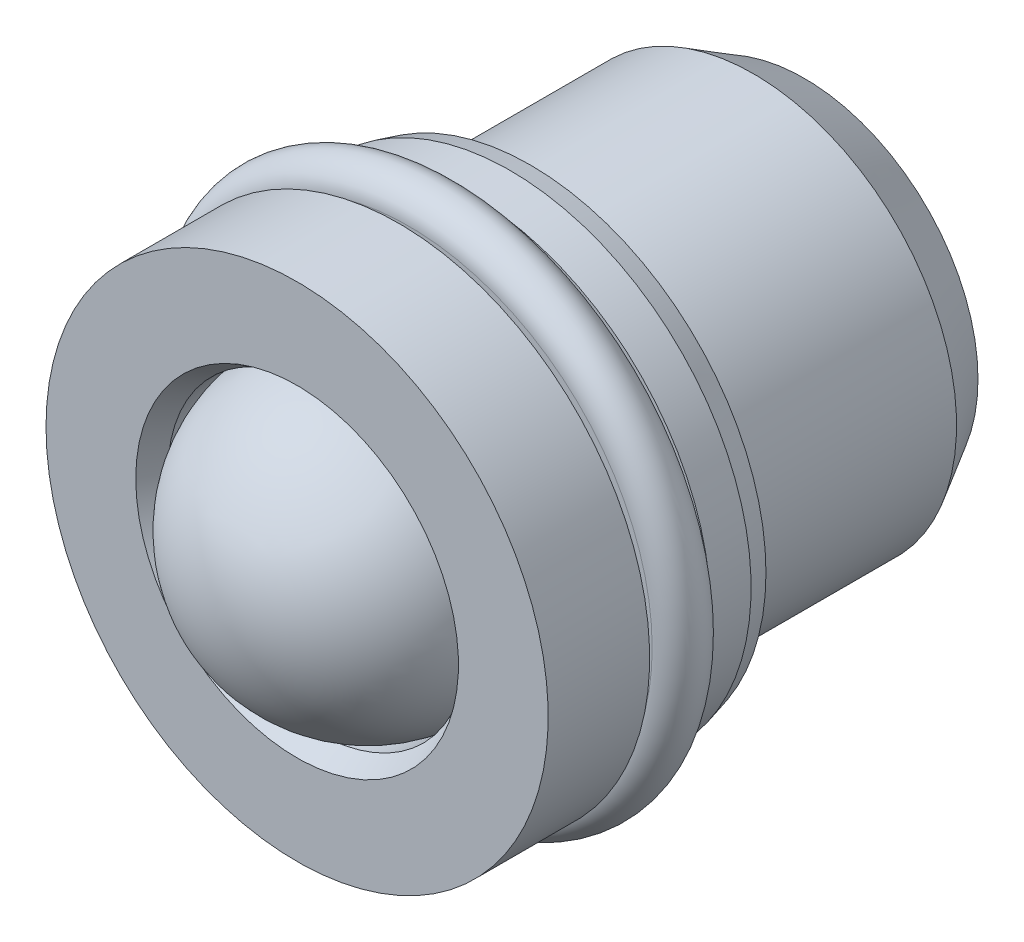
ISO-10303-21;
HEADER;
FILE_DESCRIPTION(('STEP AP214'),'2;1');
FILE_NAME('part.step','',(''),(''),'','','');
FILE_SCHEMA(('AUTOMOTIVE_DESIGN { 1 0 10303 214 1 1 1 1 }'));
ENDSEC;
DATA;
#1=APPLICATION_CONTEXT('core data for automotive mechanical design processes');
#2=APPLICATION_PROTOCOL_DEFINITION('international standard','automotive_design',2000,#1);
#3=PRODUCT_CONTEXT('',#1,'mechanical');
#4=PRODUCT('Part','Part','',(#3));
#5=PRODUCT_RELATED_PRODUCT_CATEGORY('part','',(#4));
#6=PRODUCT_DEFINITION_FORMATION('','',#4);
#7=PRODUCT_DEFINITION_CONTEXT('part definition',#1,'design');
#8=PRODUCT_DEFINITION('design','',#6,#7);
#9=PRODUCT_DEFINITION_SHAPE('','',#8);
#10=(LENGTH_UNIT() NAMED_UNIT(*) SI_UNIT(.MILLI.,.METRE.));
#11=(NAMED_UNIT(*) PLANE_ANGLE_UNIT() SI_UNIT($,.RADIAN.));
#12=(NAMED_UNIT(*) SI_UNIT($,.STERADIAN.) SOLID_ANGLE_UNIT());
#13=UNCERTAINTY_MEASURE_WITH_UNIT(LENGTH_MEASURE(1.E-05),#10,'distance_accuracy_value','');
#14=(GEOMETRIC_REPRESENTATION_CONTEXT(3) GLOBAL_UNCERTAINTY_ASSIGNED_CONTEXT((#13)) GLOBAL_UNIT_ASSIGNED_CONTEXT((#10,
#11,#12)) REPRESENTATION_CONTEXT('',''));
#15=CARTESIAN_POINT('',(0.,0.,0.));
#16=DIRECTION('',(0.,0.,1.));
#17=DIRECTION('',(1.,0.,0.));
#18=AXIS2_PLACEMENT_3D('',#15,#16,#17);
#19=CARTESIAN_POINT('',(0.,0.,-2.2));
#20=DIRECTION('',(0.,0.,1.));
#21=DIRECTION('',(1.,0.,0.));
#22=AXIS2_PLACEMENT_3D('',#19,#20,#21);
#23=CONICAL_SURFACE('',#22,2.,0.523598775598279);
#24=CARTESIAN_POINT('',(0.,0.,-2.7));
#25=DIRECTION('',(0.,0.,-1.));
#26=DIRECTION('',(-1.,0.,0.));
#27=AXIS2_PLACEMENT_3D('',#24,#25,#26);
#28=CIRCLE('',#27,1.7113248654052);
#29=CARTESIAN_POINT('',(-1.7113248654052,0.,-2.7));
#30=VERTEX_POINT('',#29);
#31=EDGE_CURVE('E18',#30,#30,#28,.T.);
#32=ORIENTED_EDGE('',*,*,#31,.F.);
#33=EDGE_LOOP('',(#32));
#34=FACE_BOUND('',#33,.T.);
#35=CARTESIAN_POINT('',(0.,0.,-2.2));
#36=DIRECTION('',(0.,0.,-1.));
#37=DIRECTION('',(-1.,0.,0.));
#38=AXIS2_PLACEMENT_3D('',#35,#36,#37);
#39=CIRCLE('',#38,2.);
#40=CARTESIAN_POINT('',(-2.,0.,-2.2));
#41=VERTEX_POINT('',#40);
#42=EDGE_CURVE('E70',#41,#41,#39,.T.);
#43=ORIENTED_EDGE('',*,*,#42,.T.);
#44=EDGE_LOOP('',(#43));
#45=FACE_BOUND('',#44,.T.);
#46=ADVANCED_FACE('F12',(#34,#45),#23,.T.);
#47=CARTESIAN_POINT('',(0.,1.7113248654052,-2.7));
#48=DIRECTION('',(0.,0.,1.));
#49=DIRECTION('',(1.,0.,0.));
#50=AXIS2_PLACEMENT_3D('',#47,#48,#49);
#51=PLANE('',#50);
#52=ORIENTED_EDGE('',*,*,#31,.T.);
#53=EDGE_LOOP('',(#52));
#54=FACE_BOUND('',#53,.T.);
#55=ADVANCED_FACE('F168',(#54),#51,.F.);
#56=CARTESIAN_POINT('',(0.,0.,2.3));
#57=DIRECTION('',(0.,0.,-1.));
#58=DIRECTION('',(-1.,0.,0.));
#59=AXIS2_PLACEMENT_3D('',#56,#57,#58);
#60=CYLINDRICAL_SURFACE('',#59,1.475);
#61=CARTESIAN_POINT('',(0.,0.,1.87271780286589));
#62=DIRECTION('',(0.,0.,-1.));
#63=DIRECTION('',(-1.,0.,0.));
#64=AXIS2_PLACEMENT_3D('',#61,#62,#63);
#65=CIRCLE('',#64,1.475);
#66=CARTESIAN_POINT('',(-1.475,0.,1.87271780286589));
#67=VERTEX_POINT('',#66);
#68=EDGE_CURVE('E8',#67,#67,#65,.T.);
#69=ORIENTED_EDGE('',*,*,#68,.T.);
#70=EDGE_LOOP('',(#69));
#71=FACE_BOUND('',#70,.T.);
#72=CARTESIAN_POINT('',(0.,0.,2.1));
#73=DIRECTION('',(0.,0.,-1.));
#74=DIRECTION('',(-1.,0.,0.));
#75=AXIS2_PLACEMENT_3D('',#72,#73,#74);
#76=CIRCLE('',#75,1.475);
#77=CARTESIAN_POINT('',(-1.475,0.,2.1));
#78=VERTEX_POINT('',#77);
#79=EDGE_CURVE('E22',#78,#78,#76,.T.);
#80=ORIENTED_EDGE('',*,*,#79,.F.);
#81=EDGE_LOOP('',(#80));
#82=FACE_BOUND('',#81,.T.);
#83=ADVANCED_FACE('F163',(#71,#82),#60,.F.);
#84=CARTESIAN_POINT('',(0.,0.,2.1));
#85=DIRECTION('',(0.,0.,1.));
#86=DIRECTION('',(1.,0.,0.));
#87=AXIS2_PLACEMENT_3D('',#84,#85,#86);
#88=CONICAL_SURFACE('',#87,1.475,0.523598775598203);
#89=CARTESIAN_POINT('',(0.,0.,2.3));
#90=DIRECTION('',(0.,0.,-1.));
#91=DIRECTION('',(-1.,0.,0.));
#92=AXIS2_PLACEMENT_3D('',#89,#90,#91);
#93=CIRCLE('',#92,1.5904700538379);
#94=CARTESIAN_POINT('',(-1.5904700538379,0.,2.3));
#95=VERTEX_POINT('',#94);
#96=EDGE_CURVE('E26',#95,#95,#93,.T.);
#97=ORIENTED_EDGE('',*,*,#96,.F.);
#98=EDGE_LOOP('',(#97));
#99=FACE_BOUND('',#98,.T.);
#100=ORIENTED_EDGE('',*,*,#79,.T.);
#101=EDGE_LOOP('',(#100));
#102=FACE_BOUND('',#101,.T.);
#103=ADVANCED_FACE('F157',(#99,#102),#88,.F.);
#104=CARTESIAN_POINT('',(0.,1.5904700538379,2.3));
#105=DIRECTION('',(0.,0.,-1.));
#106=DIRECTION('',(-1.,0.,0.));
#107=AXIS2_PLACEMENT_3D('',#104,#105,#106);
#108=PLANE('',#107);
#109=CARTESIAN_POINT('',(0.,0.,2.3));
#110=DIRECTION('',(0.,0.,-1.));
#111=DIRECTION('',(-1.,0.,0.));
#112=AXIS2_PLACEMENT_3D('',#109,#110,#111);
#113=CIRCLE('',#112,2.475);
#114=CARTESIAN_POINT('',(-2.475,0.,2.3));
#115=VERTEX_POINT('',#114);
#116=EDGE_CURVE('E31',#115,#115,#113,.T.);
#117=ORIENTED_EDGE('',*,*,#116,.F.);
#118=EDGE_LOOP('',(#117));
#119=FACE_BOUND('',#118,.T.);
#120=ORIENTED_EDGE('',*,*,#96,.T.);
#121=EDGE_LOOP('',(#120));
#122=FACE_BOUND('',#121,.T.);
#123=ADVANCED_FACE('F151',(#119,#122),#108,.F.);
#124=CARTESIAN_POINT('',(0.,0.,2.3));
#125=DIRECTION('',(0.,0.,-1.));
#126=DIRECTION('',(-1.,0.,0.));
#127=AXIS2_PLACEMENT_3D('',#124,#125,#126);
#128=CYLINDRICAL_SURFACE('',#127,2.475);
#129=CARTESIAN_POINT('',(0.,0.,1.3));
#130=DIRECTION('',(0.,0.,-1.));
#131=DIRECTION('',(-1.,0.,0.));
#132=AXIS2_PLACEMENT_3D('',#129,#130,#131);
#133=CIRCLE('',#132,2.475);
#134=CARTESIAN_POINT('',(-2.475,0.,1.3));
#135=VERTEX_POINT('',#134);
#136=EDGE_CURVE('E34',#135,#135,#133,.T.);
#137=ORIENTED_EDGE('',*,*,#136,.F.);
#138=EDGE_LOOP('',(#137));
#139=FACE_BOUND('',#138,.T.);
#140=ORIENTED_EDGE('',*,*,#116,.T.);
#141=EDGE_LOOP('',(#140));
#142=FACE_BOUND('',#141,.T.);
#143=ADVANCED_FACE('F145',(#139,#142),#128,.T.);
#144=CARTESIAN_POINT('',(0.,2.475,1.3));
#145=DIRECTION('',(0.,0.,1.));
#146=DIRECTION('',(1.,0.,0.));
#147=AXIS2_PLACEMENT_3D('',#144,#145,#146);
#148=PLANE('',#147);
#149=CARTESIAN_POINT('',(0.,0.,1.3));
#150=DIRECTION('',(0.,0.,-1.));
#151=DIRECTION('',(-1.,0.,0.));
#152=AXIS2_PLACEMENT_3D('',#149,#150,#151);
#153=CIRCLE('',#152,2.15);
#154=CARTESIAN_POINT('',(-2.15,0.,1.3));
#155=VERTEX_POINT('',#154);
#156=EDGE_CURVE('E37',#155,#155,#153,.T.);
#157=ORIENTED_EDGE('',*,*,#156,.F.);
#158=EDGE_LOOP('',(#157));
#159=FACE_BOUND('',#158,.T.);
#160=ORIENTED_EDGE('',*,*,#136,.T.);
#161=EDGE_LOOP('',(#160));
#162=FACE_BOUND('',#161,.T.);
#163=ADVANCED_FACE('F139',(#159,#162),#148,.F.);
#164=CARTESIAN_POINT('',(0.,0.,2.3));
#165=DIRECTION('',(0.,0.,-1.));
#166=DIRECTION('',(-1.,0.,0.));
#167=AXIS2_PLACEMENT_3D('',#164,#165,#166);
#168=CYLINDRICAL_SURFACE('',#167,2.15);
#169=CARTESIAN_POINT('',(0.,0.,1.2));
#170=DIRECTION('',(0.,0.,-1.));
#171=DIRECTION('',(-1.,0.,0.));
#172=AXIS2_PLACEMENT_3D('',#169,#170,#171);
#173=CIRCLE('',#172,2.15);
#174=CARTESIAN_POINT('',(-2.15,0.,1.2));
#175=VERTEX_POINT('',#174);
#176=EDGE_CURVE('E40',#175,#175,#173,.T.);
#177=ORIENTED_EDGE('',*,*,#176,.F.);
#178=EDGE_LOOP('',(#177));
#179=FACE_BOUND('',#178,.T.);
#180=ORIENTED_EDGE('',*,*,#156,.T.);
#181=EDGE_LOOP('',(#180));
#182=FACE_BOUND('',#181,.T.);
#183=ADVANCED_FACE('F133',(#179,#182),#168,.T.);
#184=CARTESIAN_POINT('',(0.,2.15,1.2));
#185=DIRECTION('',(0.,0.,-1.));
#186=DIRECTION('',(-1.,0.,0.));
#187=AXIS2_PLACEMENT_3D('',#184,#185,#186);
#188=PLANE('',#187);
#189=CARTESIAN_POINT('',(0.,0.,1.2));
#190=DIRECTION('',(0.,0.,-1.));
#191=DIRECTION('',(-1.,0.,0.));
#192=AXIS2_PLACEMENT_3D('',#189,#190,#191);
#193=CIRCLE('',#192,2.4);
#194=CARTESIAN_POINT('',(-2.4,0.,1.2));
#195=VERTEX_POINT('',#194);
#196=EDGE_CURVE('E43',#195,#195,#193,.T.);
#197=ORIENTED_EDGE('',*,*,#196,.F.);
#198=EDGE_LOOP('',(#197));
#199=FACE_BOUND('',#198,.T.);
#200=ORIENTED_EDGE('',*,*,#176,.T.);
#201=EDGE_LOOP('',(#200));
#202=FACE_BOUND('',#201,.T.);
#203=ADVANCED_FACE('F127',(#199,#202),#188,.F.);
#204=CARTESIAN_POINT('',(0.,0.,0.950000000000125));
#205=DIRECTION('',(0.,0.,-1.));
#206=DIRECTION('',(-1.,0.,0.));
#207=AXIS2_PLACEMENT_3D('',#204,#205,#206);
#208=TOROIDAL_SURFACE('',#207,2.39999999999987,0.250000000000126);
#209=CARTESIAN_POINT('',(0.,0.,0.7));
#210=DIRECTION('',(0.,0.,-1.));
#211=DIRECTION('',(-1.,0.,0.));
#212=AXIS2_PLACEMENT_3D('',#209,#210,#211);
#213=CIRCLE('',#212,2.4);
#214=CARTESIAN_POINT('',(-2.4,0.,0.7));
#215=VERTEX_POINT('',#214);
#216=EDGE_CURVE('E46',#215,#215,#213,.T.);
#217=ORIENTED_EDGE('',*,*,#216,.F.);
#218=EDGE_LOOP('',(#217));
#219=FACE_BOUND('',#218,.T.);
#220=ORIENTED_EDGE('',*,*,#196,.T.);
#221=EDGE_LOOP('',(#220));
#222=FACE_BOUND('',#221,.T.);
#223=ADVANCED_FACE('F121',(#219,#222),#208,.T.);
#224=CARTESIAN_POINT('',(0.,2.4,0.7));
#225=DIRECTION('',(0.,0.,1.));
#226=DIRECTION('',(1.,0.,0.));
#227=AXIS2_PLACEMENT_3D('',#224,#225,#226);
#228=PLANE('',#227);
#229=CARTESIAN_POINT('',(0.,0.,0.7));
#230=DIRECTION('',(0.,0.,-1.));
#231=DIRECTION('',(-1.,0.,0.));
#232=AXIS2_PLACEMENT_3D('',#229,#230,#231);
#233=CIRCLE('',#232,2.15);
#234=CARTESIAN_POINT('',(-2.15,0.,0.7));
#235=VERTEX_POINT('',#234);
#236=EDGE_CURVE('E49',#235,#235,#233,.T.);
#237=ORIENTED_EDGE('',*,*,#236,.F.);
#238=EDGE_LOOP('',(#237));
#239=FACE_BOUND('',#238,.T.);
#240=ORIENTED_EDGE('',*,*,#216,.T.);
#241=EDGE_LOOP('',(#240));
#242=FACE_BOUND('',#241,.T.);
#243=ADVANCED_FACE('F115',(#239,#242),#228,.F.);
#244=CARTESIAN_POINT('',(0.,0.,2.3));
#245=DIRECTION('',(0.,0.,-1.));
#246=DIRECTION('',(-1.,0.,0.));
#247=AXIS2_PLACEMENT_3D('',#244,#245,#246);
#248=CYLINDRICAL_SURFACE('',#247,2.15);
#249=CARTESIAN_POINT('',(0.,0.,0.6));
#250=DIRECTION('',(0.,0.,-1.));
#251=DIRECTION('',(-1.,0.,0.));
#252=AXIS2_PLACEMENT_3D('',#249,#250,#251);
#253=CIRCLE('',#252,2.15);
#254=CARTESIAN_POINT('',(-2.15,0.,0.6));
#255=VERTEX_POINT('',#254);
#256=EDGE_CURVE('E52',#255,#255,#253,.T.);
#257=ORIENTED_EDGE('',*,*,#256,.F.);
#258=EDGE_LOOP('',(#257));
#259=FACE_BOUND('',#258,.T.);
#260=ORIENTED_EDGE('',*,*,#236,.T.);
#261=EDGE_LOOP('',(#260));
#262=FACE_BOUND('',#261,.T.);
#263=ADVANCED_FACE('F109',(#259,#262),#248,.T.);
#264=CARTESIAN_POINT('',(0.,2.15,0.6));
#265=DIRECTION('',(0.,0.,-1.));
#266=DIRECTION('',(-1.,0.,0.));
#267=AXIS2_PLACEMENT_3D('',#264,#265,#266);
#268=PLANE('',#267);
#269=CARTESIAN_POINT('',(0.,0.,0.6));
#270=DIRECTION('',(0.,0.,-1.));
#271=DIRECTION('',(-1.,0.,0.));
#272=AXIS2_PLACEMENT_3D('',#269,#270,#271);
#273=CIRCLE('',#272,2.375);
#274=CARTESIAN_POINT('',(-2.375,0.,0.6));
#275=VERTEX_POINT('',#274);
#276=EDGE_CURVE('E55',#275,#275,#273,.T.);
#277=ORIENTED_EDGE('',*,*,#276,.F.);
#278=EDGE_LOOP('',(#277));
#279=FACE_BOUND('',#278,.T.);
#280=ORIENTED_EDGE('',*,*,#256,.T.);
#281=EDGE_LOOP('',(#280));
#282=FACE_BOUND('',#281,.T.);
#283=ADVANCED_FACE('F103',(#279,#282),#268,.F.);
#284=CARTESIAN_POINT('',(0.,0.,2.3));
#285=DIRECTION('',(0.,0.,-1.));
#286=DIRECTION('',(-1.,0.,0.));
#287=AXIS2_PLACEMENT_3D('',#284,#285,#286);
#288=CYLINDRICAL_SURFACE('',#287,2.375);
#289=CARTESIAN_POINT('',(0.,0.,0.2));
#290=DIRECTION('',(0.,0.,-1.));
#291=DIRECTION('',(-1.,0.,0.));
#292=AXIS2_PLACEMENT_3D('',#289,#290,#291);
#293=CIRCLE('',#292,2.375);
#294=CARTESIAN_POINT('',(-2.375,0.,0.2));
#295=VERTEX_POINT('',#294);
#296=EDGE_CURVE('E58',#295,#295,#293,.T.);
#297=ORIENTED_EDGE('',*,*,#296,.F.);
#298=EDGE_LOOP('',(#297));
#299=FACE_BOUND('',#298,.T.);
#300=ORIENTED_EDGE('',*,*,#276,.T.);
#301=EDGE_LOOP('',(#300));
#302=FACE_BOUND('',#301,.T.);
#303=ADVANCED_FACE('F97',(#299,#302),#288,.T.);
#304=CARTESIAN_POINT('',(0.,0.,0.2));
#305=DIRECTION('',(0.,0.,1.));
#306=DIRECTION('',(1.,0.,0.));
#307=AXIS2_PLACEMENT_3D('',#304,#305,#306);
#308=CONICAL_SURFACE('',#307,2.375,0.261799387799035);
#309=CARTESIAN_POINT('',(0.,0.,0.));
#310=DIRECTION('',(0.,0.,-1.));
#311=DIRECTION('',(-1.,0.,0.));
#312=AXIS2_PLACEMENT_3D('',#309,#310,#311);
#313=CIRCLE('',#312,2.3214101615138);
#314=CARTESIAN_POINT('',(-2.3214101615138,0.,0.));
#315=VERTEX_POINT('',#314);
#316=EDGE_CURVE('E61',#315,#315,#313,.T.);
#317=ORIENTED_EDGE('',*,*,#316,.F.);
#318=EDGE_LOOP('',(#317));
#319=FACE_BOUND('',#318,.T.);
#320=ORIENTED_EDGE('',*,*,#296,.T.);
#321=EDGE_LOOP('',(#320));
#322=FACE_BOUND('',#321,.T.);
#323=ADVANCED_FACE('F91',(#319,#322),#308,.T.);
#324=CARTESIAN_POINT('',(0.,2.3214101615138,0.));
#325=DIRECTION('',(0.,0.,1.));
#326=DIRECTION('',(1.,0.,0.));
#327=AXIS2_PLACEMENT_3D('',#324,#325,#326);
#328=PLANE('',#327);
#329=CARTESIAN_POINT('',(0.,0.,0.));
#330=DIRECTION('',(0.,0.,-1.));
#331=DIRECTION('',(-1.,0.,0.));
#332=AXIS2_PLACEMENT_3D('',#329,#330,#331);
#333=CIRCLE('',#332,2.2);
#334=CARTESIAN_POINT('',(-2.2,0.,0.));
#335=VERTEX_POINT('',#334);
#336=EDGE_CURVE('E64',#335,#335,#333,.T.);
#337=ORIENTED_EDGE('',*,*,#336,.F.);
#338=EDGE_LOOP('',(#337));
#339=FACE_BOUND('',#338,.T.);
#340=ORIENTED_EDGE('',*,*,#316,.T.);
#341=EDGE_LOOP('',(#340));
#342=FACE_BOUND('',#341,.T.);
#343=ADVANCED_FACE('F85',(#339,#342),#328,.F.);
#344=CARTESIAN_POINT('',(0.,0.,-0.20000000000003));
#345=DIRECTION('',(0.,0.,-1.));
#346=DIRECTION('',(-1.,0.,0.));
#347=AXIS2_PLACEMENT_3D('',#344,#345,#346);
#348=TOROIDAL_SURFACE('',#347,2.20000000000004,0.200000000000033);
#349=CARTESIAN_POINT('',(0.,0.,-0.2));
#350=DIRECTION('',(0.,0.,-1.));
#351=DIRECTION('',(-1.,0.,0.));
#352=AXIS2_PLACEMENT_3D('',#349,#350,#351);
#353=CIRCLE('',#352,2.);
#354=CARTESIAN_POINT('',(-2.,0.,-0.2));
#355=VERTEX_POINT('',#354);
#356=EDGE_CURVE('E67',#355,#355,#353,.T.);
#357=ORIENTED_EDGE('',*,*,#356,.F.);
#358=EDGE_LOOP('',(#357));
#359=FACE_BOUND('',#358,.T.);
#360=ORIENTED_EDGE('',*,*,#336,.T.);
#361=EDGE_LOOP('',(#360));
#362=FACE_BOUND('',#361,.T.);
#363=ADVANCED_FACE('F79',(#359,#362),#348,.F.);
#364=CARTESIAN_POINT('',(0.,0.,2.3));
#365=DIRECTION('',(0.,0.,-1.));
#366=DIRECTION('',(-1.,0.,0.));
#367=AXIS2_PLACEMENT_3D('',#364,#365,#366);
#368=CYLINDRICAL_SURFACE('',#367,2.);
#369=ORIENTED_EDGE('',*,*,#42,.F.);
#370=EDGE_LOOP('',(#369));
#371=FACE_BOUND('',#370,.T.);
#372=ORIENTED_EDGE('',*,*,#356,.T.);
#373=EDGE_LOOP('',(#372));
#374=FACE_BOUND('',#373,.T.);
#375=ADVANCED_FACE('F75',(#371,#374),#368,.T.);
#376=CARTESIAN_POINT('',(0.,0.,1.6));
#377=DIRECTION('',(0.,0.,-1.));
#378=DIRECTION('',(0.,-1.,0.));
#379=AXIS2_PLACEMENT_3D('',#376,#377,#378);
#380=SPHERICAL_SURFACE('',#379,1.5);
#381=ORIENTED_EDGE('',*,*,#68,.F.);
#382=EDGE_LOOP('',(#381));
#383=FACE_BOUND('',#382,.T.);
#384=ADVANCED_FACE('F78',(#383),#380,.T.);
#385=CLOSED_SHELL('',(#46,#55,#83,#103,#123,#143,#163,#183,#203,#223,#243,#263,#283,#303,#323,
#343,#363,#375,#384));
#386=MANIFOLD_SOLID_BREP('B1',#385);
#387=ADVANCED_BREP_SHAPE_REPRESENTATION('',(#18,#386),#14);
#388=SHAPE_DEFINITION_REPRESENTATION(#9,#387);
ENDSEC;
END-ISO-10303-21;
